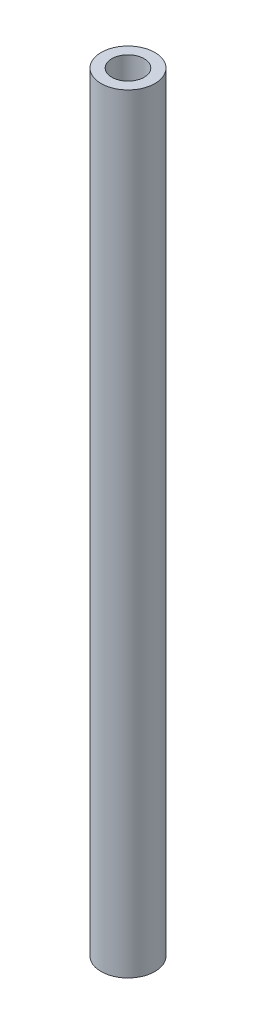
ISO-10303-21;
HEADER;
FILE_DESCRIPTION(('STEP AP214'),'2;1');
FILE_NAME('part.step','',(''),(''),'','','');
FILE_SCHEMA(('AUTOMOTIVE_DESIGN { 1 0 10303 214 1 1 1 1 }'));
ENDSEC;
DATA;
#1=APPLICATION_CONTEXT('core data for automotive mechanical design processes');
#2=APPLICATION_PROTOCOL_DEFINITION('international standard','automotive_design',2000,#1);
#3=PRODUCT_CONTEXT('',#1,'mechanical');
#4=PRODUCT('Part','Part','',(#3));
#5=PRODUCT_RELATED_PRODUCT_CATEGORY('part','',(#4));
#6=PRODUCT_DEFINITION_FORMATION('','',#4);
#7=PRODUCT_DEFINITION_CONTEXT('part definition',#1,'design');
#8=PRODUCT_DEFINITION('design','',#6,#7);
#9=PRODUCT_DEFINITION_SHAPE('','',#8);
#10=(LENGTH_UNIT() NAMED_UNIT(*) SI_UNIT(.MILLI.,.METRE.));
#11=(NAMED_UNIT(*) PLANE_ANGLE_UNIT() SI_UNIT($,.RADIAN.));
#12=(NAMED_UNIT(*) SI_UNIT($,.STERADIAN.) SOLID_ANGLE_UNIT());
#13=UNCERTAINTY_MEASURE_WITH_UNIT(LENGTH_MEASURE(1.E-05),#10,'distance_accuracy_value','');
#14=(GEOMETRIC_REPRESENTATION_CONTEXT(3) GLOBAL_UNCERTAINTY_ASSIGNED_CONTEXT((#13)) GLOBAL_UNIT_ASSIGNED_CONTEXT((#10,
#11,#12)) REPRESENTATION_CONTEXT('',''));
#15=CARTESIAN_POINT('',(0.,0.,0.));
#16=DIRECTION('',(0.,0.,1.));
#17=DIRECTION('',(1.,0.,0.));
#18=AXIS2_PLACEMENT_3D('',#15,#16,#17);
#19=CARTESIAN_POINT('',(0.,0.,0.));
#20=DIRECTION('',(0.,1.,0.));
#21=DIRECTION('',(1.,0.,0.));
#22=AXIS2_PLACEMENT_3D('',#19,#20,#21);
#23=PLANE('',#22);
#24=CARTESIAN_POINT('',(0.,0.,0.));
#25=DIRECTION('',(0.,1.,0.));
#26=DIRECTION('',(0.,0.,1.));
#27=AXIS2_PLACEMENT_3D('',#24,#25,#26);
#28=CIRCLE('',#27,2.1);
#29=CARTESIAN_POINT('',(0.,0.,2.1));
#30=VERTEX_POINT('',#29);
#31=EDGE_CURVE('E32',#30,#30,#28,.T.);
#32=ORIENTED_EDGE('',*,*,#31,.T.);
#33=EDGE_LOOP('',(#32));
#34=FACE_BOUND('',#33,.T.);
#35=CARTESIAN_POINT('',(0.,0.,0.));
#36=DIRECTION('',(0.,1.,0.));
#37=DIRECTION('',(0.,0.,1.));
#38=AXIS2_PLACEMENT_3D('',#35,#36,#37);
#39=CIRCLE('',#38,3.5);
#40=CARTESIAN_POINT('',(0.,0.,3.5));
#41=VERTEX_POINT('',#40);
#42=EDGE_CURVE('E10',#41,#41,#39,.T.);
#43=ORIENTED_EDGE('',*,*,#42,.F.);
#44=EDGE_LOOP('',(#43));
#45=FACE_BOUND('',#44,.T.);
#46=ADVANCED_FACE('F15',(#34,#45),#23,.F.);
#47=CARTESIAN_POINT('',(0.,100.,0.));
#48=DIRECTION('',(0.,1.,0.));
#49=DIRECTION('',(1.,0.,0.));
#50=AXIS2_PLACEMENT_3D('',#47,#48,#49);
#51=PLANE('',#50);
#52=CARTESIAN_POINT('',(0.,100.,0.));
#53=DIRECTION('',(0.,1.,0.));
#54=DIRECTION('',(0.,0.,1.));
#55=AXIS2_PLACEMENT_3D('',#52,#53,#54);
#56=CIRCLE('',#55,2.1);
#57=CARTESIAN_POINT('',(0.,100.,2.1));
#58=VERTEX_POINT('',#57);
#59=EDGE_CURVE('E34',#58,#58,#56,.T.);
#60=ORIENTED_EDGE('',*,*,#59,.F.);
#61=EDGE_LOOP('',(#60));
#62=FACE_BOUND('',#61,.T.);
#63=CARTESIAN_POINT('',(0.,100.,0.));
#64=DIRECTION('',(0.,1.,0.));
#65=DIRECTION('',(0.,0.,1.));
#66=AXIS2_PLACEMENT_3D('',#63,#64,#65);
#67=CIRCLE('',#66,3.5);
#68=CARTESIAN_POINT('',(0.,100.,3.5));
#69=VERTEX_POINT('',#68);
#70=EDGE_CURVE('E18',#69,#69,#67,.T.);
#71=ORIENTED_EDGE('',*,*,#70,.T.);
#72=EDGE_LOOP('',(#71));
#73=FACE_BOUND('',#72,.T.);
#74=ADVANCED_FACE('F49',(#62,#73),#51,.T.);
#75=CARTESIAN_POINT('',(0.,100.,0.));
#76=DIRECTION('',(0.,-1.,0.));
#77=DIRECTION('',(0.,0.,-1.));
#78=AXIS2_PLACEMENT_3D('',#75,#76,#77);
#79=CYLINDRICAL_SURFACE('',#78,3.5);
#80=ORIENTED_EDGE('',*,*,#42,.T.);
#81=EDGE_LOOP('',(#80));
#82=FACE_BOUND('',#81,.T.);
#83=ORIENTED_EDGE('',*,*,#70,.F.);
#84=EDGE_LOOP('',(#83));
#85=FACE_BOUND('',#84,.T.);
#86=ADVANCED_FACE('F52',(#82,#85),#79,.T.);
#87=CARTESIAN_POINT('',(0.,100.,0.));
#88=DIRECTION('',(0.,-1.,0.));
#89=DIRECTION('',(0.,0.,-1.));
#90=AXIS2_PLACEMENT_3D('',#87,#88,#89);
#91=CYLINDRICAL_SURFACE('',#90,2.1);
#92=ORIENTED_EDGE('',*,*,#31,.F.);
#93=EDGE_LOOP('',(#92));
#94=FACE_BOUND('',#93,.T.);
#95=ORIENTED_EDGE('',*,*,#59,.T.);
#96=EDGE_LOOP('',(#95));
#97=FACE_BOUND('',#96,.T.);
#98=ADVANCED_FACE('F47',(#94,#97),#91,.F.);
#99=CLOSED_SHELL('',(#46,#74,#86,#98));
#100=MANIFOLD_SOLID_BREP('B1',#99);
#101=ADVANCED_BREP_SHAPE_REPRESENTATION('',(#18,#100),#14);
#102=SHAPE_DEFINITION_REPRESENTATION(#9,#101);
ENDSEC;
END-ISO-10303-21;
